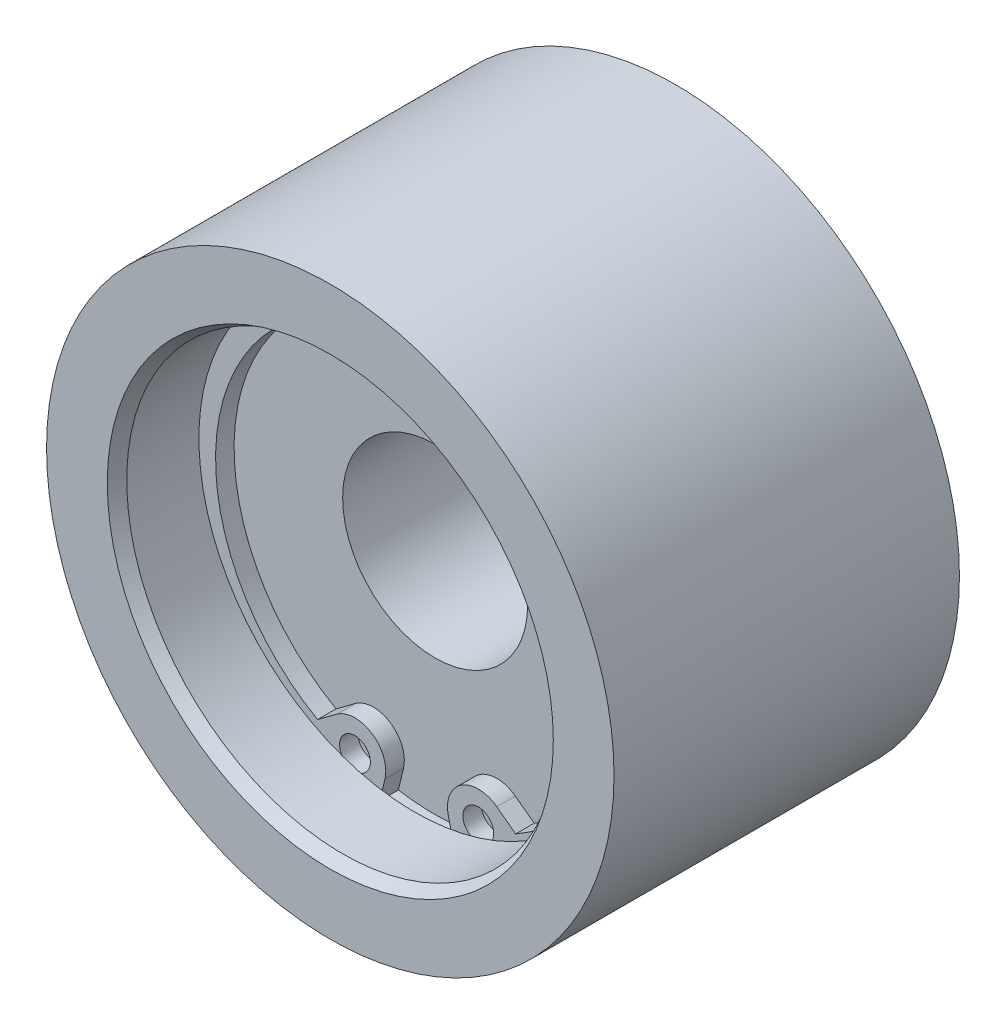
ISO-10303-21;
HEADER;
FILE_DESCRIPTION(('STEP AP214'),'2;1');
FILE_NAME('part.step','',(''),(''),'','','');
FILE_SCHEMA(('AUTOMOTIVE_DESIGN { 1 0 10303 214 1 1 1 1 }'));
ENDSEC;
DATA;
#1=APPLICATION_CONTEXT('core data for automotive mechanical design processes');
#2=APPLICATION_PROTOCOL_DEFINITION('international standard','automotive_design',2000,#1);
#3=PRODUCT_CONTEXT('',#1,'mechanical');
#4=PRODUCT('Part','Part','',(#3));
#5=PRODUCT_RELATED_PRODUCT_CATEGORY('part','',(#4));
#6=PRODUCT_DEFINITION_FORMATION('','',#4);
#7=PRODUCT_DEFINITION_CONTEXT('part definition',#1,'design');
#8=PRODUCT_DEFINITION('design','',#6,#7);
#9=PRODUCT_DEFINITION_SHAPE('','',#8);
#10=(LENGTH_UNIT() NAMED_UNIT(*) SI_UNIT(.MILLI.,.METRE.));
#11=(NAMED_UNIT(*) PLANE_ANGLE_UNIT() SI_UNIT($,.RADIAN.));
#12=(NAMED_UNIT(*) SI_UNIT($,.STERADIAN.) SOLID_ANGLE_UNIT());
#13=UNCERTAINTY_MEASURE_WITH_UNIT(LENGTH_MEASURE(1.E-05),#10,'distance_accuracy_value','');
#14=(GEOMETRIC_REPRESENTATION_CONTEXT(3) GLOBAL_UNCERTAINTY_ASSIGNED_CONTEXT((#13)) GLOBAL_UNIT_ASSIGNED_CONTEXT((#10,
#11,#12)) REPRESENTATION_CONTEXT('',''));
#15=CARTESIAN_POINT('',(0.,0.,0.));
#16=DIRECTION('',(0.,0.,1.));
#17=DIRECTION('',(1.,0.,0.));
#18=AXIS2_PLACEMENT_3D('',#15,#16,#17);
#19=CARTESIAN_POINT('',(0.,-0.9,7.1));
#20=DIRECTION('',(0.,0.,1.));
#21=DIRECTION('',(-1.,0.,0.));
#22=AXIS2_PLACEMENT_3D('',#19,#20,#21);
#23=CYLINDRICAL_SURFACE('',#22,16.3);
#24=CARTESIAN_POINT('',(0.,-0.9,7.));
#25=DIRECTION('',(0.,0.,1.));
#26=DIRECTION('',(1.,0.,0.));
#27=AXIS2_PLACEMENT_3D('',#24,#25,#26);
#28=CIRCLE('',#27,16.3);
#29=CARTESIAN_POINT('',(-8.02922574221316,-15.0852576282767,7.));
#30=VERTEX_POINT('',#29);
#31=CARTESIAN_POINT('',(8.02922574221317,-15.0852576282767,7.));
#32=VERTEX_POINT('',#31);
#33=EDGE_CURVE('E269',#30,#32,#28,.F.);
#34=ORIENTED_EDGE('',*,*,#33,.F.);
#35=DIRECTION('',(0.,0.,-1.));
#36=VECTOR('',#35,1.);
#37=CARTESIAN_POINT('',(-8.02922574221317,-15.0852576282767,7.1));
#38=LINE('',#37,#36);
#39=CARTESIAN_POINT('',(-8.02922574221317,-15.0852576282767,5.5));
#40=VERTEX_POINT('',#39);
#41=EDGE_CURVE('E234',#30,#40,#38,.T.);
#42=ORIENTED_EDGE('',*,*,#41,.T.);
#43=CARTESIAN_POINT('',(0.,-0.9,5.5));
#44=DIRECTION('',(0.,0.,-1.));
#45=DIRECTION('',(0.,-1.,0.));
#46=AXIS2_PLACEMENT_3D('',#43,#44,#45);
#47=CIRCLE('',#46,16.3);
#48=CARTESIAN_POINT('',(8.02922574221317,-15.0852576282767,5.5));
#49=VERTEX_POINT('',#48);
#50=EDGE_CURVE('E220',#40,#49,#47,.T.);
#51=ORIENTED_EDGE('',*,*,#50,.T.);
#52=DIRECTION('',(0.,0.,-1.));
#53=VECTOR('',#52,1.);
#54=CARTESIAN_POINT('',(8.02922574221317,-15.0852576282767,7.1));
#55=LINE('',#54,#53);
#56=EDGE_CURVE('E235',#32,#49,#55,.T.);
#57=ORIENTED_EDGE('',*,*,#56,.F.);
#58=EDGE_LOOP('',(#34,#42,#51,#57));
#59=FACE_BOUND('',#58,.T.);
#60=ADVANCED_FACE('F14',(#59),#23,.F.);
#61=CARTESIAN_POINT('',(6.49138441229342,-13.9421779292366,7.1));
#62=DIRECTION('',(-0.596553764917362,-0.802573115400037,0.));
#63=DIRECTION('',(-0.802573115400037,0.596553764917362,0.));
#64=AXIS2_PLACEMENT_3D('',#61,#62,#63);
#65=PLANE('',#64);
#66=DIRECTION('',(-0.802573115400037,0.596553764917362,0.));
#67=VECTOR('',#66,1.);
#68=CARTESIAN_POINT('',(6.49138441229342,-13.9421779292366,7.));
#69=LINE('',#68,#67);
#70=CARTESIAN_POINT('',(6.49138441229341,-13.9421779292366,7.));
#71=VERTEX_POINT('',#70);
#72=EDGE_CURVE('E271',#32,#71,#69,.T.);
#73=ORIENTED_EDGE('',*,*,#72,.F.);
#74=ORIENTED_EDGE('',*,*,#56,.T.);
#75=DIRECTION('',(-0.802573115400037,0.596553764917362,0.));
#76=VECTOR('',#75,1.);
#77=CARTESIAN_POINT('',(6.49138441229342,-13.9421779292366,5.5));
#78=LINE('',#77,#76);
#79=CARTESIAN_POINT('',(6.49138441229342,-13.9421779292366,5.5));
#80=VERTEX_POINT('',#79);
#81=EDGE_CURVE('E231',#49,#80,#78,.T.);
#82=ORIENTED_EDGE('',*,*,#81,.T.);
#83=DIRECTION('',(0.,0.,-1.));
#84=VECTOR('',#83,1.);
#85=CARTESIAN_POINT('',(6.49138441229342,-13.9421779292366,7.1));
#86=LINE('',#85,#84);
#87=EDGE_CURVE('E251',#71,#80,#86,.T.);
#88=ORIENTED_EDGE('',*,*,#87,.F.);
#89=EDGE_LOOP('',(#73,#74,#82,#88));
#90=FACE_BOUND('',#89,.T.);
#91=ADVANCED_FACE('F169',(#90),#65,.F.);
#92=CARTESIAN_POINT('',(5.,-15.9486107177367,7.1));
#93=DIRECTION('',(0.,0.,1.));
#94=DIRECTION('',(-1.,0.,0.));
#95=AXIS2_PLACEMENT_3D('',#92,#93,#94);
#96=CYLINDRICAL_SURFACE('',#95,2.5);
#97=DIRECTION('',(0.,0.,-1.));
#98=VECTOR('',#97,1.);
#99=CARTESIAN_POINT('',(2.5678231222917,-16.526983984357,7.1));
#100=LINE('',#99,#98);
#101=CARTESIAN_POINT('',(2.5678231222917,-16.526983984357,7.));
#102=VERTEX_POINT('',#101);
#103=CARTESIAN_POINT('',(2.5678231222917,-16.526983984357,5.5));
#104=VERTEX_POINT('',#103);
#105=EDGE_CURVE('E226',#102,#104,#100,.T.);
#106=ORIENTED_EDGE('',*,*,#105,.F.);
#107=CARTESIAN_POINT('',(5.,-15.9486107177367,7.));
#108=DIRECTION('',(0.,0.,1.));
#109=DIRECTION('',(1.,0.,0.));
#110=AXIS2_PLACEMENT_3D('',#107,#108,#109);
#111=CIRCLE('',#110,2.5);
#112=EDGE_CURVE('E273',#102,#71,#111,.F.);
#113=ORIENTED_EDGE('',*,*,#112,.T.);
#114=ORIENTED_EDGE('',*,*,#87,.T.);
#115=CARTESIAN_POINT('',(5.,-15.9486107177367,5.5));
#116=DIRECTION('',(0.,0.,1.));
#117=DIRECTION('',(1.,0.,0.));
#118=AXIS2_PLACEMENT_3D('',#115,#116,#117);
#119=CIRCLE('',#118,2.5);
#120=EDGE_CURVE('E113',#80,#104,#119,.T.);
#121=ORIENTED_EDGE('',*,*,#120,.T.);
#122=EDGE_LOOP('',(#106,#113,#114,#121));
#123=FACE_BOUND('',#122,.T.);
#124=ADVANCED_FACE('F175',(#123),#96,.T.);
#125=CARTESIAN_POINT('',(-2.56782312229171,-16.526983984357,7.1));
#126=DIRECTION('',(-0.97287075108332,0.231349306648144,0.));
#127=DIRECTION('',(0.,0.,1.));
#128=AXIS2_PLACEMENT_3D('',#125,#126,#127);
#129=PLANE('',#128);
#130=DIRECTION('',(0.231349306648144,0.97287075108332,0.));
#131=VECTOR('',#130,1.);
#132=CARTESIAN_POINT('',(-2.56782312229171,-16.526983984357,7.));
#133=LINE('',#132,#131);
#134=CARTESIAN_POINT('',(-2.97957431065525,-18.2584812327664,7.));
#135=VERTEX_POINT('',#134);
#136=CARTESIAN_POINT('',(-2.5678231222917,-16.526983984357,7.));
#137=VERTEX_POINT('',#136);
#138=EDGE_CURVE('E89',#135,#137,#133,.T.);
#139=ORIENTED_EDGE('',*,*,#138,.F.);
#140=DIRECTION('',(0.,0.,1.));
#141=VECTOR('',#140,1.);
#142=CARTESIAN_POINT('',(-2.97957431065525,-18.2584812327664,17.6183293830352));
#143=LINE('',#142,#141);
#144=CARTESIAN_POINT('',(-2.97957431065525,-18.2584812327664,5.5));
#145=VERTEX_POINT('',#144);
#146=EDGE_CURVE('E22',#145,#135,#143,.T.);
#147=ORIENTED_EDGE('',*,*,#146,.F.);
#148=DIRECTION('',(0.231349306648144,0.97287075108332,0.));
#149=VECTOR('',#148,1.);
#150=CARTESIAN_POINT('',(-2.56782312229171,-16.526983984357,5.5));
#151=LINE('',#150,#149);
#152=CARTESIAN_POINT('',(-2.56782312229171,-16.526983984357,5.5));
#153=VERTEX_POINT('',#152);
#154=EDGE_CURVE('E35',#145,#153,#151,.T.);
#155=ORIENTED_EDGE('',*,*,#154,.T.);
#156=DIRECTION('',(0.,0.,-1.));
#157=VECTOR('',#156,1.);
#158=CARTESIAN_POINT('',(-2.56782312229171,-16.526983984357,7.1));
#159=LINE('',#158,#157);
#160=EDGE_CURVE('E98',#137,#153,#159,.T.);
#161=ORIENTED_EDGE('',*,*,#160,.F.);
#162=EDGE_LOOP('',(#139,#147,#155,#161));
#163=FACE_BOUND('',#162,.T.);
#164=ADVANCED_FACE('F97',(#163),#129,.F.);
#165=CARTESIAN_POINT('',(-6.49138441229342,-13.9421779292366,7.1));
#166=DIRECTION('',(0.596553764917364,-0.802573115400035,0.));
#167=DIRECTION('',(0.,0.,-1.));
#168=AXIS2_PLACEMENT_3D('',#165,#166,#167);
#169=PLANE('',#168);
#170=DIRECTION('',(-0.802573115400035,-0.596553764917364,0.));
#171=VECTOR('',#170,1.);
#172=CARTESIAN_POINT('',(-6.49138441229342,-13.9421779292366,7.));
#173=LINE('',#172,#171);
#174=CARTESIAN_POINT('',(-6.49138441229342,-13.9421779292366,7.));
#175=VERTEX_POINT('',#174);
#176=EDGE_CURVE('E267',#175,#30,#173,.T.);
#177=ORIENTED_EDGE('',*,*,#176,.F.);
#178=DIRECTION('',(0.,0.,-1.));
#179=VECTOR('',#178,1.);
#180=CARTESIAN_POINT('',(-6.49138441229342,-13.9421779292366,7.1));
#181=LINE('',#180,#179);
#182=CARTESIAN_POINT('',(-6.49138441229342,-13.9421779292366,5.5));
#183=VERTEX_POINT('',#182);
#184=EDGE_CURVE('E109',#175,#183,#181,.T.);
#185=ORIENTED_EDGE('',*,*,#184,.T.);
#186=DIRECTION('',(-0.802573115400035,-0.596553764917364,0.));
#187=VECTOR('',#186,1.);
#188=CARTESIAN_POINT('',(-6.49138441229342,-13.9421779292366,5.5));
#189=LINE('',#188,#187);
#190=EDGE_CURVE('E105',#183,#40,#189,.T.);
#191=ORIENTED_EDGE('',*,*,#190,.T.);
#192=ORIENTED_EDGE('',*,*,#41,.F.);
#193=EDGE_LOOP('',(#177,#185,#191,#192));
#194=FACE_BOUND('',#193,.T.);
#195=ADVANCED_FACE('F185',(#194),#169,.F.);
#196=CARTESIAN_POINT('',(-5.,-15.9486107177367,7.1));
#197=DIRECTION('',(0.,0.,1.));
#198=DIRECTION('',(-1.,0.,0.));
#199=AXIS2_PLACEMENT_3D('',#196,#197,#198);
#200=CYLINDRICAL_SURFACE('',#199,2.5);
#201=ORIENTED_EDGE('',*,*,#184,.F.);
#202=CARTESIAN_POINT('',(-5.,-15.9486107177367,7.));
#203=DIRECTION('',(0.,0.,1.));
#204=DIRECTION('',(1.,0.,0.));
#205=AXIS2_PLACEMENT_3D('',#202,#203,#204);
#206=CIRCLE('',#205,2.5);
#207=EDGE_CURVE('E100',#175,#137,#206,.F.);
#208=ORIENTED_EDGE('',*,*,#207,.T.);
#209=ORIENTED_EDGE('',*,*,#160,.T.);
#210=CARTESIAN_POINT('',(-5.,-15.9486107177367,5.5));
#211=DIRECTION('',(0.,0.,1.));
#212=DIRECTION('',(-1.,0.,0.));
#213=AXIS2_PLACEMENT_3D('',#210,#211,#212);
#214=CIRCLE('',#213,2.5);
#215=EDGE_CURVE('E208',#153,#183,#214,.T.);
#216=ORIENTED_EDGE('',*,*,#215,.T.);
#217=EDGE_LOOP('',(#201,#208,#209,#216));
#218=FACE_BOUND('',#217,.T.);
#219=ADVANCED_FACE('F192',(#218),#200,.T.);
#220=CARTESIAN_POINT('',(2.5678231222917,-16.526983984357,7.1));
#221=DIRECTION('',(0.972870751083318,0.231349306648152,0.));
#222=DIRECTION('',(0.,0.,-1.));
#223=AXIS2_PLACEMENT_3D('',#220,#221,#222);
#224=PLANE('',#223);
#225=DIRECTION('',(0.231349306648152,-0.972870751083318,0.));
#226=VECTOR('',#225,1.);
#227=CARTESIAN_POINT('',(2.5678231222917,-16.526983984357,7.));
#228=LINE('',#227,#226);
#229=CARTESIAN_POINT('',(2.97957431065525,-18.2584812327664,7.));
#230=VERTEX_POINT('',#229);
#231=EDGE_CURVE('E92',#102,#230,#228,.T.);
#232=ORIENTED_EDGE('',*,*,#231,.F.);
#233=ORIENTED_EDGE('',*,*,#105,.T.);
#234=DIRECTION('',(0.231349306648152,-0.972870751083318,0.));
#235=VECTOR('',#234,1.);
#236=CARTESIAN_POINT('',(2.5678231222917,-16.526983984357,5.5));
#237=LINE('',#236,#235);
#238=CARTESIAN_POINT('',(2.97957431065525,-18.2584812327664,5.5));
#239=VERTEX_POINT('',#238);
#240=EDGE_CURVE('E224',#104,#239,#237,.T.);
#241=ORIENTED_EDGE('',*,*,#240,.T.);
#242=DIRECTION('',(0.,0.,1.));
#243=VECTOR('',#242,1.);
#244=CARTESIAN_POINT('',(2.97957431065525,-18.2584812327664,17.6183293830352));
#245=LINE('',#244,#243);
#246=EDGE_CURVE('E9',#230,#239,#245,.F.);
#247=ORIENTED_EDGE('',*,*,#246,.F.);
#248=EDGE_LOOP('',(#232,#233,#241,#247));
#249=FACE_BOUND('',#248,.T.);
#250=ADVANCED_FACE('F181',(#249),#224,.F.);
#251=CARTESIAN_POINT('',(0.,0.,17.6183293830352));
#252=DIRECTION('',(0.,0.,1.));
#253=DIRECTION('',(1.,0.,0.));
#254=AXIS2_PLACEMENT_3D('',#251,#252,#253);
#255=CYLINDRICAL_SURFACE('',#254,23.);
#256=CARTESIAN_POINT('',(0.,0.,-14.));
#257=DIRECTION('',(0.,0.,-1.));
#258=DIRECTION('',(-1.,0.,0.));
#259=AXIS2_PLACEMENT_3D('',#256,#257,#258);
#260=CIRCLE('',#259,23.);
#261=CARTESIAN_POINT('',(-23.,0.,-14.));
#262=VERTEX_POINT('',#261);
#263=EDGE_CURVE('E120',#262,#262,#260,.T.);
#264=ORIENTED_EDGE('',*,*,#263,.F.);
#265=EDGE_LOOP('',(#264));
#266=FACE_BOUND('',#265,.T.);
#267=CARTESIAN_POINT('',(0.,0.,14.));
#268=DIRECTION('',(0.,0.,-1.));
#269=DIRECTION('',(-1.,0.,0.));
#270=AXIS2_PLACEMENT_3D('',#267,#268,#269);
#271=CIRCLE('',#270,23.);
#272=CARTESIAN_POINT('',(-23.,0.,14.));
#273=VERTEX_POINT('',#272);
#274=EDGE_CURVE('E123',#273,#273,#271,.T.);
#275=ORIENTED_EDGE('',*,*,#274,.T.);
#276=EDGE_LOOP('',(#275));
#277=FACE_BOUND('',#276,.T.);
#278=ADVANCED_FACE('F204',(#266,#277),#255,.T.);
#279=CARTESIAN_POINT('',(0.,35.,14.));
#280=DIRECTION('',(0.,0.,-1.));
#281=DIRECTION('',(-1.,0.,0.));
#282=AXIS2_PLACEMENT_3D('',#279,#280,#281);
#283=PLANE('',#282);
#284=CARTESIAN_POINT('',(0.,0.,14.));
#285=DIRECTION('',(0.,0.,1.));
#286=DIRECTION('',(1.,0.,0.));
#287=AXIS2_PLACEMENT_3D('',#284,#285,#286);
#288=CIRCLE('',#287,18.0773502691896);
#289=CARTESIAN_POINT('',(18.0773502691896,0.,14.));
#290=VERTEX_POINT('',#289);
#291=EDGE_CURVE('E126',#290,#290,#288,.T.);
#292=ORIENTED_EDGE('',*,*,#291,.F.);
#293=EDGE_LOOP('',(#292));
#294=FACE_BOUND('',#293,.T.);
#295=ORIENTED_EDGE('',*,*,#274,.F.);
#296=EDGE_LOOP('',(#295));
#297=FACE_BOUND('',#296,.T.);
#298=ADVANCED_FACE('F388',(#294,#297),#283,.F.);
#299=CARTESIAN_POINT('',(0.,14.5,-14.));
#300=DIRECTION('',(0.,0.,1.));
#301=DIRECTION('',(1.,0.,0.));
#302=AXIS2_PLACEMENT_3D('',#299,#300,#301);
#303=PLANE('',#302);
#304=CARTESIAN_POINT('',(0.,0.,-14.));
#305=DIRECTION('',(0.,0.,1.));
#306=DIRECTION('',(1.,0.,0.));
#307=AXIS2_PLACEMENT_3D('',#304,#305,#306);
#308=CIRCLE('',#307,14.5);
#309=CARTESIAN_POINT('',(14.5,0.,-14.));
#310=VERTEX_POINT('',#309);
#311=EDGE_CURVE('E142',#310,#310,#308,.T.);
#312=ORIENTED_EDGE('',*,*,#311,.T.);
#313=EDGE_LOOP('',(#312));
#314=FACE_BOUND('',#313,.T.);
#315=ORIENTED_EDGE('',*,*,#263,.T.);
#316=EDGE_LOOP('',(#315));
#317=FACE_BOUND('',#316,.T.);
#318=ADVANCED_FACE('F16',(#314,#317),#303,.F.);
#319=CARTESIAN_POINT('',(0.,0.,14.));
#320=DIRECTION('',(0.,0.,1.));
#321=DIRECTION('',(1.,0.,0.));
#322=AXIS2_PLACEMENT_3D('',#319,#320,#321);
#323=CONICAL_SURFACE('',#322,18.0773502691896,0.5235987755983);
#324=CARTESIAN_POINT('',(0.,0.,13.));
#325=DIRECTION('',(0.,0.,1.));
#326=DIRECTION('',(1.,0.,0.));
#327=AXIS2_PLACEMENT_3D('',#324,#325,#326);
#328=CIRCLE('',#327,17.5);
#329=CARTESIAN_POINT('',(17.5,0.,13.));
#330=VERTEX_POINT('',#329);
#331=EDGE_CURVE('E129',#330,#330,#328,.T.);
#332=ORIENTED_EDGE('',*,*,#331,.F.);
#333=EDGE_LOOP('',(#332));
#334=FACE_BOUND('',#333,.T.);
#335=ORIENTED_EDGE('',*,*,#291,.T.);
#336=EDGE_LOOP('',(#335));
#337=FACE_BOUND('',#336,.T.);
#338=ADVANCED_FACE('F404',(#334,#337),#323,.F.);
#339=CARTESIAN_POINT('',(0.,0.,17.6183293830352));
#340=DIRECTION('',(0.,0.,1.));
#341=DIRECTION('',(1.,0.,0.));
#342=AXIS2_PLACEMENT_3D('',#339,#340,#341);
#343=CYLINDRICAL_SURFACE('',#342,14.5);
#344=ORIENTED_EDGE('',*,*,#311,.F.);
#345=EDGE_LOOP('',(#344));
#346=FACE_BOUND('',#345,.T.);
#347=CARTESIAN_POINT('',(0.,0.,-5.5));
#348=DIRECTION('',(0.,0.,1.));
#349=DIRECTION('',(1.,0.,0.));
#350=AXIS2_PLACEMENT_3D('',#347,#348,#349);
#351=CIRCLE('',#350,14.5);
#352=CARTESIAN_POINT('',(14.5,0.,-5.5));
#353=VERTEX_POINT('',#352);
#354=EDGE_CURVE('E139',#353,#353,#351,.T.);
#355=ORIENTED_EDGE('',*,*,#354,.T.);
#356=EDGE_LOOP('',(#355));
#357=FACE_BOUND('',#356,.T.);
#358=ADVANCED_FACE('F412',(#346,#357),#343,.F.);
#359=CARTESIAN_POINT('',(0.,0.,17.6183293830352));
#360=DIRECTION('',(0.,0.,1.));
#361=DIRECTION('',(1.,0.,0.));
#362=AXIS2_PLACEMENT_3D('',#359,#360,#361);
#363=CYLINDRICAL_SURFACE('',#362,17.5);
#364=CARTESIAN_POINT('',(0.,0.,7.15));
#365=DIRECTION('',(0.,0.,1.));
#366=DIRECTION('',(1.,0.,0.));
#367=AXIS2_PLACEMENT_3D('',#364,#365,#366);
#368=CIRCLE('',#367,17.5);
#369=CARTESIAN_POINT('',(17.5,0.,7.15));
#370=VERTEX_POINT('',#369);
#371=EDGE_CURVE('E118',#370,#370,#368,.F.);
#372=ORIENTED_EDGE('',*,*,#371,.T.);
#373=EDGE_LOOP('',(#372));
#374=FACE_BOUND('',#373,.T.);
#375=ORIENTED_EDGE('',*,*,#331,.T.);
#376=EDGE_LOOP('',(#375));
#377=FACE_BOUND('',#376,.T.);
#378=ADVANCED_FACE('F148',(#374,#377),#363,.F.);
#379=CARTESIAN_POINT('',(0.,14.5,-5.5));
#380=DIRECTION('',(0.,0.,1.));
#381=DIRECTION('',(1.,0.,0.));
#382=AXIS2_PLACEMENT_3D('',#379,#380,#381);
#383=PLANE('',#382);
#384=ORIENTED_EDGE('',*,*,#354,.F.);
#385=EDGE_LOOP('',(#384));
#386=FACE_BOUND('',#385,.T.);
#387=CARTESIAN_POINT('',(0.,0.,-5.5));
#388=DIRECTION('',(0.,0.,1.));
#389=DIRECTION('',(1.,0.,0.));
#390=AXIS2_PLACEMENT_3D('',#387,#388,#389);
#391=CIRCLE('',#390,7.5);
#392=CARTESIAN_POINT('',(7.5,0.,-5.5));
#393=VERTEX_POINT('',#392);
#394=EDGE_CURVE('E136',#393,#393,#391,.T.);
#395=ORIENTED_EDGE('',*,*,#394,.T.);
#396=EDGE_LOOP('',(#395));
#397=FACE_BOUND('',#396,.T.);
#398=ADVANCED_FACE('F153',(#386,#397),#383,.F.);
#399=CARTESIAN_POINT('',(0.,0.,7.15));
#400=DIRECTION('',(0.,0.,1.));
#401=DIRECTION('',(1.,0.,0.));
#402=AXIS2_PLACEMENT_3D('',#399,#400,#401);
#403=PLANE('',#402);
#404=CARTESIAN_POINT('',(0.,0.,7.15));
#405=DIRECTION('',(0.,0.,1.));
#406=DIRECTION('',(1.,0.,0.));
#407=AXIS2_PLACEMENT_3D('',#404,#405,#406);
#408=CIRCLE('',#407,18.5);
#409=CARTESIAN_POINT('',(18.5,0.,7.15));
#410=VERTEX_POINT('',#409);
#411=EDGE_CURVE('E115',#410,#410,#408,.T.);
#412=ORIENTED_EDGE('',*,*,#411,.F.);
#413=EDGE_LOOP('',(#412));
#414=FACE_BOUND('',#413,.T.);
#415=ORIENTED_EDGE('',*,*,#371,.F.);
#416=EDGE_LOOP('',(#415));
#417=FACE_BOUND('',#416,.T.);
#418=ADVANCED_FACE('F151',(#414,#417),#403,.F.);
#419=CARTESIAN_POINT('',(0.,0.,17.6183293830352));
#420=DIRECTION('',(0.,0.,1.));
#421=DIRECTION('',(1.,0.,0.));
#422=AXIS2_PLACEMENT_3D('',#419,#420,#421);
#423=CYLINDRICAL_SURFACE('',#422,18.5);
#424=CARTESIAN_POINT('',(0.,0.,7.));
#425=DIRECTION('',(0.,0.,1.));
#426=DIRECTION('',(1.,0.,0.));
#427=AXIS2_PLACEMENT_3D('',#424,#425,#426);
#428=CIRCLE('',#427,18.5);
#429=EDGE_CURVE('E85',#230,#135,#428,.T.);
#430=ORIENTED_EDGE('',*,*,#429,.F.);
#431=ORIENTED_EDGE('',*,*,#246,.T.);
#432=CARTESIAN_POINT('',(0.,0.,5.5));
#433=DIRECTION('',(0.,0.,1.));
#434=DIRECTION('',(1.,0.,0.));
#435=AXIS2_PLACEMENT_3D('',#432,#433,#434);
#436=CIRCLE('',#435,18.5);
#437=EDGE_CURVE('E104',#145,#239,#436,.T.);
#438=ORIENTED_EDGE('',*,*,#437,.F.);
#439=ORIENTED_EDGE('',*,*,#146,.T.);
#440=EDGE_LOOP('',(#430,#431,#438,#439));
#441=FACE_BOUND('',#440,.T.);
#442=ORIENTED_EDGE('',*,*,#411,.T.);
#443=EDGE_LOOP('',(#442));
#444=FACE_BOUND('',#443,.T.);
#445=ADVANCED_FACE('F102',(#441,#444),#423,.F.);
#446=CARTESIAN_POINT('',(0.,0.,17.6183293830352));
#447=DIRECTION('',(0.,0.,1.));
#448=DIRECTION('',(1.,0.,0.));
#449=AXIS2_PLACEMENT_3D('',#446,#447,#448);
#450=CYLINDRICAL_SURFACE('',#449,7.5);
#451=ORIENTED_EDGE('',*,*,#394,.F.);
#452=EDGE_LOOP('',(#451));
#453=FACE_BOUND('',#452,.T.);
#454=CARTESIAN_POINT('',(0.,0.,5.5));
#455=DIRECTION('',(0.,0.,1.));
#456=DIRECTION('',(1.,0.,0.));
#457=AXIS2_PLACEMENT_3D('',#454,#455,#456);
#458=CIRCLE('',#457,7.5);
#459=CARTESIAN_POINT('',(7.5,0.,5.5));
#460=VERTEX_POINT('',#459);
#461=EDGE_CURVE('E133',#460,#460,#458,.T.);
#462=ORIENTED_EDGE('',*,*,#461,.T.);
#463=EDGE_LOOP('',(#462));
#464=FACE_BOUND('',#463,.T.);
#465=ADVANCED_FACE('F161',(#453,#464),#450,.F.);
#466=CARTESIAN_POINT('',(0.,7.5,5.5));
#467=DIRECTION('',(0.,0.,-1.));
#468=DIRECTION('',(-1.,0.,0.));
#469=AXIS2_PLACEMENT_3D('',#466,#467,#468);
#470=PLANE('',#469);
#471=ORIENTED_EDGE('',*,*,#461,.F.);
#472=EDGE_LOOP('',(#471));
#473=FACE_BOUND('',#472,.T.);
#474=ORIENTED_EDGE('',*,*,#437,.T.);
#475=ORIENTED_EDGE('',*,*,#240,.F.);
#476=ORIENTED_EDGE('',*,*,#120,.F.);
#477=ORIENTED_EDGE('',*,*,#81,.F.);
#478=ORIENTED_EDGE('',*,*,#50,.F.);
#479=ORIENTED_EDGE('',*,*,#190,.F.);
#480=ORIENTED_EDGE('',*,*,#215,.F.);
#481=ORIENTED_EDGE('',*,*,#154,.F.);
#482=EDGE_LOOP('',(#474,#475,#476,#477,#478,#479,#480,#481));
#483=FACE_BOUND('',#482,.T.);
#484=ADVANCED_FACE('F280',(#473,#483),#470,.F.);
#485=CARTESIAN_POINT('',(0.,0.,7.));
#486=DIRECTION('',(0.,0.,1.));
#487=DIRECTION('',(1.,0.,0.));
#488=AXIS2_PLACEMENT_3D('',#485,#486,#487);
#489=PLANE('',#488);
#490=ORIENTED_EDGE('',*,*,#138,.T.);
#491=ORIENTED_EDGE('',*,*,#207,.F.);
#492=ORIENTED_EDGE('',*,*,#176,.T.);
#493=ORIENTED_EDGE('',*,*,#33,.T.);
#494=ORIENTED_EDGE('',*,*,#72,.T.);
#495=ORIENTED_EDGE('',*,*,#112,.F.);
#496=ORIENTED_EDGE('',*,*,#231,.T.);
#497=ORIENTED_EDGE('',*,*,#429,.T.);
#498=EDGE_LOOP('',(#490,#491,#492,#493,#494,#495,#496,#497));
#499=FACE_BOUND('',#498,.T.);
#500=CARTESIAN_POINT('',(-5.,-15.9486107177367,7.));
#501=DIRECTION('',(0.,0.,1.));
#502=DIRECTION('',(1.,0.,0.));
#503=AXIS2_PLACEMENT_3D('',#500,#501,#502);
#504=CIRCLE('',#503,1.25);
#505=CARTESIAN_POINT('',(-3.75,-15.9486107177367,7.));
#506=VERTEX_POINT('',#505);
#507=EDGE_CURVE('E99',#506,#506,#504,.F.);
#508=ORIENTED_EDGE('',*,*,#507,.T.);
#509=EDGE_LOOP('',(#508));
#510=FACE_BOUND('',#509,.T.);
#511=CARTESIAN_POINT('',(5.,-15.9486107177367,7.));
#512=DIRECTION('',(0.,0.,1.));
#513=DIRECTION('',(1.,0.,0.));
#514=AXIS2_PLACEMENT_3D('',#511,#512,#513);
#515=CIRCLE('',#514,1.25);
#516=CARTESIAN_POINT('',(6.25,-15.9486107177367,7.));
#517=VERTEX_POINT('',#516);
#518=EDGE_CURVE('E119',#517,#517,#515,.F.);
#519=ORIENTED_EDGE('',*,*,#518,.T.);
#520=EDGE_LOOP('',(#519));
#521=FACE_BOUND('',#520,.T.);
#522=ADVANCED_FACE('F87',(#499,#510,#521),#489,.T.);
#523=CARTESIAN_POINT('',(-5.,-15.9486107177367,5.5));
#524=DIRECTION('',(0.,0.,-1.));
#525=DIRECTION('',(1.,0.,0.));
#526=AXIS2_PLACEMENT_3D('',#523,#524,#525);
#527=CIRCLE('',#526,1.25);
#528=CARTESIAN_POINT('',(-3.75,-15.9486107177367,5.5));
#529=VERTEX_POINT('',#528);
#530=EDGE_CURVE('E144',#529,#529,#527,.T.);
#531=ORIENTED_EDGE('',*,*,#530,.F.);
#532=EDGE_LOOP('',(#531));
#533=FACE_BOUND('',#532,.T.);
#534=ADVANCED_FACE('F197',(#533),#470,.F.);
#535=CARTESIAN_POINT('',(-5.,-15.9486107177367,7.1));
#536=DIRECTION('',(0.,0.,1.));
#537=DIRECTION('',(-1.,0.,0.));
#538=AXIS2_PLACEMENT_3D('',#535,#536,#537);
#539=CYLINDRICAL_SURFACE('',#538,1.25);
#540=ORIENTED_EDGE('',*,*,#530,.T.);
#541=EDGE_LOOP('',(#540));
#542=FACE_BOUND('',#541,.T.);
#543=ORIENTED_EDGE('',*,*,#507,.F.);
#544=EDGE_LOOP('',(#543));
#545=FACE_BOUND('',#544,.T.);
#546=ADVANCED_FACE('F195',(#542,#545),#539,.F.);
#547=CARTESIAN_POINT('',(5.,-15.9486107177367,5.5));
#548=DIRECTION('',(0.,0.,1.));
#549=DIRECTION('',(1.,0.,0.));
#550=AXIS2_PLACEMENT_3D('',#547,#548,#549);
#551=CIRCLE('',#550,1.25);
#552=CARTESIAN_POINT('',(6.25,-15.9486107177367,5.5));
#553=VERTEX_POINT('',#552);
#554=EDGE_CURVE('E212',#553,#553,#551,.T.);
#555=ORIENTED_EDGE('',*,*,#554,.T.);
#556=EDGE_LOOP('',(#555));
#557=FACE_BOUND('',#556,.T.);
#558=ADVANCED_FACE('F189',(#557),#470,.F.);
#559=CARTESIAN_POINT('',(5.,-15.9486107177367,7.1));
#560=DIRECTION('',(0.,0.,1.));
#561=DIRECTION('',(-1.,0.,0.));
#562=AXIS2_PLACEMENT_3D('',#559,#560,#561);
#563=CYLINDRICAL_SURFACE('',#562,1.25);
#564=ORIENTED_EDGE('',*,*,#554,.F.);
#565=EDGE_LOOP('',(#564));
#566=FACE_BOUND('',#565,.T.);
#567=ORIENTED_EDGE('',*,*,#518,.F.);
#568=EDGE_LOOP('',(#567));
#569=FACE_BOUND('',#568,.T.);
#570=ADVANCED_FACE('F186',(#566,#569),#563,.F.);
#571=CLOSED_SHELL('',(#60,#91,#124,#164,#195,#219,#250,#278,#298,#318,#338,#358,#378,#398,#418,
#445,#465,#484,#522,#534,#546,#558,#570));
#572=MANIFOLD_SOLID_BREP('B1',#571);
#573=ADVANCED_BREP_SHAPE_REPRESENTATION('',(#18,#572),#14);
#574=SHAPE_DEFINITION_REPRESENTATION(#9,#573);
ENDSEC;
END-ISO-10303-21;
